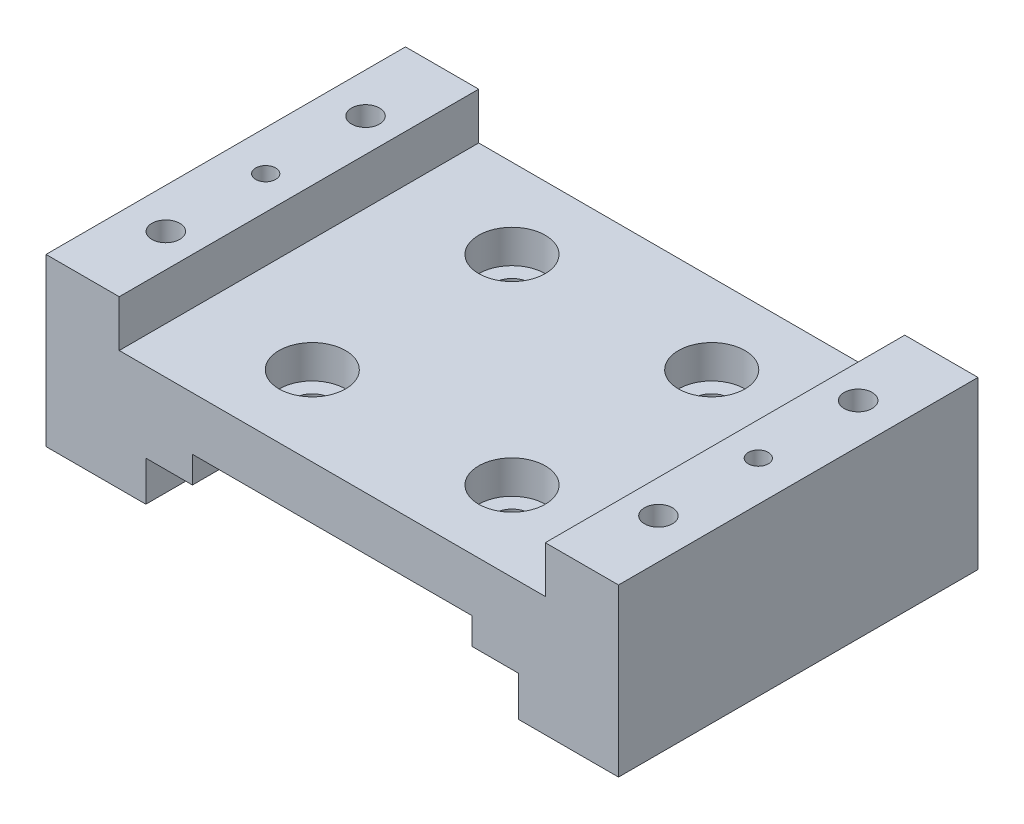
ISO-10303-21;
HEADER;
FILE_DESCRIPTION(('STEP AP214'),'2;1');
FILE_NAME('part.step','',(''),(''),'','','');
FILE_SCHEMA(('AUTOMOTIVE_DESIGN { 1 0 10303 214 1 1 1 1 }'));
ENDSEC;
DATA;
#1=APPLICATION_CONTEXT('core data for automotive mechanical design processes');
#2=APPLICATION_PROTOCOL_DEFINITION('international standard','automotive_design',2000,#1);
#3=PRODUCT_CONTEXT('',#1,'mechanical');
#4=PRODUCT('Part','Part','',(#3));
#5=PRODUCT_RELATED_PRODUCT_CATEGORY('part','',(#4));
#6=PRODUCT_DEFINITION_FORMATION('','',#4);
#7=PRODUCT_DEFINITION_CONTEXT('part definition',#1,'design');
#8=PRODUCT_DEFINITION('design','',#6,#7);
#9=PRODUCT_DEFINITION_SHAPE('','',#8);
#10=(LENGTH_UNIT() NAMED_UNIT(*) SI_UNIT(.MILLI.,.METRE.));
#11=(NAMED_UNIT(*) PLANE_ANGLE_UNIT() SI_UNIT($,.RADIAN.));
#12=(NAMED_UNIT(*) SI_UNIT($,.STERADIAN.) SOLID_ANGLE_UNIT());
#13=UNCERTAINTY_MEASURE_WITH_UNIT(LENGTH_MEASURE(1.E-05),#10,'distance_accuracy_value','');
#14=(GEOMETRIC_REPRESENTATION_CONTEXT(3) GLOBAL_UNCERTAINTY_ASSIGNED_CONTEXT((#13)) GLOBAL_UNIT_ASSIGNED_CONTEXT((#10,
#11,#12)) REPRESENTATION_CONTEXT('',''));
#15=CARTESIAN_POINT('',(0.,0.,0.));
#16=DIRECTION('',(0.,0.,1.));
#17=DIRECTION('',(1.,0.,0.));
#18=AXIS2_PLACEMENT_3D('',#15,#16,#17);
#19=CARTESIAN_POINT('',(21.,0.,54.));
#20=DIRECTION('',(1.,0.,0.));
#21=DIRECTION('',(0.,0.,-1.));
#22=AXIS2_PLACEMENT_3D('',#19,#20,#21);
#23=PLANE('',#22);
#24=DIRECTION('',(0.,-1.,0.));
#25=VECTOR('',#24,1.);
#26=CARTESIAN_POINT('',(21.,0.,0.));
#27=LINE('',#26,#25);
#28=CARTESIAN_POINT('',(21.,0.,0.));
#29=VERTEX_POINT('',#28);
#30=CARTESIAN_POINT('',(21.,-4.,0.));
#31=VERTEX_POINT('',#30);
#32=EDGE_CURVE('E191',#29,#31,#27,.T.);
#33=ORIENTED_EDGE('',*,*,#32,.T.);
#34=DIRECTION('',(0.,0.,-1.));
#35=VECTOR('',#34,1.);
#36=CARTESIAN_POINT('',(21.,-4.,54.));
#37=LINE('',#36,#35);
#38=CARTESIAN_POINT('',(21.,-4.,54.));
#39=VERTEX_POINT('',#38);
#40=EDGE_CURVE('E11',#39,#31,#37,.T.);
#41=ORIENTED_EDGE('',*,*,#40,.F.);
#42=DIRECTION('',(0.,-1.,0.));
#43=VECTOR('',#42,1.);
#44=CARTESIAN_POINT('',(21.,0.,54.));
#45=LINE('',#44,#43);
#46=CARTESIAN_POINT('',(21.,0.,54.));
#47=VERTEX_POINT('',#46);
#48=EDGE_CURVE('E222',#47,#39,#45,.T.);
#49=ORIENTED_EDGE('',*,*,#48,.F.);
#50=DIRECTION('',(0.,0.,-1.));
#51=VECTOR('',#50,1.);
#52=CARTESIAN_POINT('',(21.,0.,54.));
#53=LINE('',#52,#51);
#54=EDGE_CURVE('E187',#47,#29,#53,.T.);
#55=ORIENTED_EDGE('',*,*,#54,.T.);
#56=EDGE_LOOP('',(#33,#41,#49,#55));
#57=FACE_BOUND('',#56,.T.);
#58=ADVANCED_FACE('F42',(#57),#23,.F.);
#59=CARTESIAN_POINT('',(21.,-4.,54.));
#60=DIRECTION('',(0.,1.,0.));
#61=DIRECTION('',(0.,0.,1.));
#62=AXIS2_PLACEMENT_3D('',#59,#60,#61);
#63=PLANE('',#62);
#64=DIRECTION('',(1.,0.,0.));
#65=VECTOR('',#64,1.);
#66=CARTESIAN_POINT('',(21.,-4.,0.));
#67=LINE('',#66,#65);
#68=CARTESIAN_POINT('',(28.,-4.,0.));
#69=VERTEX_POINT('',#68);
#70=EDGE_CURVE('E194',#31,#69,#67,.T.);
#71=ORIENTED_EDGE('',*,*,#70,.T.);
#72=DIRECTION('',(0.,0.,-1.));
#73=VECTOR('',#72,1.);
#74=CARTESIAN_POINT('',(28.,-4.,54.));
#75=LINE('',#74,#73);
#76=CARTESIAN_POINT('',(28.,-4.,54.));
#77=VERTEX_POINT('',#76);
#78=EDGE_CURVE('E51',#77,#69,#75,.T.);
#79=ORIENTED_EDGE('',*,*,#78,.F.);
#80=DIRECTION('',(1.,0.,0.));
#81=VECTOR('',#80,1.);
#82=CARTESIAN_POINT('',(21.,-4.,54.));
#83=LINE('',#82,#81);
#84=EDGE_CURVE('E128',#39,#77,#83,.T.);
#85=ORIENTED_EDGE('',*,*,#84,.F.);
#86=ORIENTED_EDGE('',*,*,#40,.T.);
#87=EDGE_LOOP('',(#71,#79,#85,#86));
#88=FACE_BOUND('',#87,.T.);
#89=ADVANCED_FACE('F370',(#88),#63,.F.);
#90=CARTESIAN_POINT('',(28.,-4.,54.));
#91=DIRECTION('',(1.,0.,0.));
#92=DIRECTION('',(0.,0.,-1.));
#93=AXIS2_PLACEMENT_3D('',#90,#91,#92);
#94=PLANE('',#93);
#95=DIRECTION('',(0.,-1.,0.));
#96=VECTOR('',#95,1.);
#97=CARTESIAN_POINT('',(28.,-4.,0.));
#98=LINE('',#97,#96);
#99=CARTESIAN_POINT('',(28.,-10.,0.));
#100=VERTEX_POINT('',#99);
#101=EDGE_CURVE('E197',#69,#100,#98,.T.);
#102=ORIENTED_EDGE('',*,*,#101,.T.);
#103=DIRECTION('',(0.,0.,-1.));
#104=VECTOR('',#103,1.);
#105=CARTESIAN_POINT('',(28.,-10.,54.));
#106=LINE('',#105,#104);
#107=CARTESIAN_POINT('',(28.,-10.,54.));
#108=VERTEX_POINT('',#107);
#109=EDGE_CURVE('E253',#108,#100,#106,.T.);
#110=ORIENTED_EDGE('',*,*,#109,.F.);
#111=DIRECTION('',(0.,-1.,0.));
#112=VECTOR('',#111,1.);
#113=CARTESIAN_POINT('',(28.,-4.,54.));
#114=LINE('',#113,#112);
#115=EDGE_CURVE('E321',#77,#108,#114,.T.);
#116=ORIENTED_EDGE('',*,*,#115,.F.);
#117=ORIENTED_EDGE('',*,*,#78,.T.);
#118=EDGE_LOOP('',(#102,#110,#116,#117));
#119=FACE_BOUND('',#118,.T.);
#120=ADVANCED_FACE('F374',(#119),#94,.F.);
#121=CARTESIAN_POINT('',(28.,-10.,54.));
#122=DIRECTION('',(0.,1.,0.));
#123=DIRECTION('',(0.,0.,1.));
#124=AXIS2_PLACEMENT_3D('',#121,#122,#123);
#125=PLANE('',#124);
#126=CARTESIAN_POINT('',(37.,-10.,31.));
#127=DIRECTION('',(0.,-1.,0.));
#128=DIRECTION('',(0.,0.,-1.));
#129=AXIS2_PLACEMENT_3D('',#126,#127,#128);
#130=CIRCLE('',#129,1.02499999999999);
#131=CARTESIAN_POINT('',(37.,-10.,29.975));
#132=VERTEX_POINT('',#131);
#133=EDGE_CURVE('E844',#132,#132,#130,.T.);
#134=ORIENTED_EDGE('',*,*,#133,.F.);
#135=EDGE_LOOP('',(#134));
#136=FACE_BOUND('',#135,.T.);
#137=CARTESIAN_POINT('',(37.,-10.,23.));
#138=DIRECTION('',(0.,-1.,0.));
#139=DIRECTION('',(0.,0.,-1.));
#140=AXIS2_PLACEMENT_3D('',#137,#138,#139);
#141=CIRCLE('',#140,1.02499999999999);
#142=CARTESIAN_POINT('',(37.,-10.,21.975));
#143=VERTEX_POINT('',#142);
#144=EDGE_CURVE('E850',#143,#143,#141,.T.);
#145=ORIENTED_EDGE('',*,*,#144,.F.);
#146=EDGE_LOOP('',(#145));
#147=FACE_BOUND('',#146,.T.);
#148=DIRECTION('',(1.,0.,0.));
#149=VECTOR('',#148,1.);
#150=CARTESIAN_POINT('',(28.,-10.,0.));
#151=LINE('',#150,#149);
#152=CARTESIAN_POINT('',(43.,-10.,0.));
#153=VERTEX_POINT('',#152);
#154=EDGE_CURVE('E199',#100,#153,#151,.T.);
#155=ORIENTED_EDGE('',*,*,#154,.T.);
#156=DIRECTION('',(0.,0.,-1.));
#157=VECTOR('',#156,1.);
#158=CARTESIAN_POINT('',(43.,-10.,54.));
#159=LINE('',#158,#157);
#160=CARTESIAN_POINT('',(43.,-10.,54.));
#161=VERTEX_POINT('',#160);
#162=EDGE_CURVE('E250',#161,#153,#159,.T.);
#163=ORIENTED_EDGE('',*,*,#162,.F.);
#164=DIRECTION('',(1.,0.,0.));
#165=VECTOR('',#164,1.);
#166=CARTESIAN_POINT('',(28.,-10.,54.));
#167=LINE('',#166,#165);
#168=EDGE_CURVE('E323',#108,#161,#167,.T.);
#169=ORIENTED_EDGE('',*,*,#168,.F.);
#170=ORIENTED_EDGE('',*,*,#109,.T.);
#171=EDGE_LOOP('',(#155,#163,#169,#170));
#172=FACE_BOUND('',#171,.T.);
#173=ADVANCED_FACE('F378',(#136,#147,#172),#125,.F.);
#174=CARTESIAN_POINT('',(43.,-10.,54.));
#175=DIRECTION('',(-1.,0.,0.));
#176=DIRECTION('',(0.,0.,1.));
#177=AXIS2_PLACEMENT_3D('',#174,#175,#176);
#178=PLANE('',#177);
#179=DIRECTION('',(0.,1.,0.));
#180=VECTOR('',#179,1.);
#181=CARTESIAN_POINT('',(43.,-10.,0.));
#182=LINE('',#181,#180);
#183=CARTESIAN_POINT('',(43.,15.,0.));
#184=VERTEX_POINT('',#183);
#185=EDGE_CURVE('E201',#153,#184,#182,.T.);
#186=ORIENTED_EDGE('',*,*,#185,.T.);
#187=DIRECTION('',(0.,0.,-1.));
#188=VECTOR('',#187,1.);
#189=CARTESIAN_POINT('',(43.,15.,54.));
#190=LINE('',#189,#188);
#191=CARTESIAN_POINT('',(43.,15.,54.));
#192=VERTEX_POINT('',#191);
#193=EDGE_CURVE('E247',#192,#184,#190,.T.);
#194=ORIENTED_EDGE('',*,*,#193,.F.);
#195=DIRECTION('',(0.,1.,0.));
#196=VECTOR('',#195,1.);
#197=CARTESIAN_POINT('',(43.,-10.,54.));
#198=LINE('',#197,#196);
#199=EDGE_CURVE('E325',#161,#192,#198,.T.);
#200=ORIENTED_EDGE('',*,*,#199,.F.);
#201=ORIENTED_EDGE('',*,*,#162,.T.);
#202=EDGE_LOOP('',(#186,#194,#200,#201));
#203=FACE_BOUND('',#202,.T.);
#204=ADVANCED_FACE('F384',(#203),#178,.F.);
#205=CARTESIAN_POINT('',(43.,15.,54.));
#206=DIRECTION('',(0.,-1.,0.));
#207=DIRECTION('',(0.,0.,-1.));
#208=AXIS2_PLACEMENT_3D('',#205,#206,#207);
#209=PLANE('',#208);
#210=CARTESIAN_POINT('',(37.,15.,27.));
#211=DIRECTION('',(0.,1.,0.));
#212=DIRECTION('',(-1.,0.,0.));
#213=AXIS2_PLACEMENT_3D('',#210,#211,#212);
#214=CIRCLE('',#213,1.5);
#215=CARTESIAN_POINT('',(35.5,15.,27.));
#216=VERTEX_POINT('',#215);
#217=EDGE_CURVE('E823',#216,#216,#214,.T.);
#218=ORIENTED_EDGE('',*,*,#217,.F.);
#219=EDGE_LOOP('',(#218));
#220=FACE_BOUND('',#219,.T.);
#221=CARTESIAN_POINT('',(37.,15.,42.));
#222=DIRECTION('',(0.,1.,0.));
#223=DIRECTION('',(0.,0.,1.));
#224=AXIS2_PLACEMENT_3D('',#221,#222,#223);
#225=CIRCLE('',#224,2.1);
#226=CARTESIAN_POINT('',(37.,15.,44.1));
#227=VERTEX_POINT('',#226);
#228=EDGE_CURVE('E302',#227,#227,#225,.T.);
#229=ORIENTED_EDGE('',*,*,#228,.F.);
#230=EDGE_LOOP('',(#229));
#231=FACE_BOUND('',#230,.T.);
#232=CARTESIAN_POINT('',(37.,15.,12.));
#233=DIRECTION('',(0.,1.,0.));
#234=DIRECTION('',(0.,0.,1.));
#235=AXIS2_PLACEMENT_3D('',#232,#233,#234);
#236=CIRCLE('',#235,2.1);
#237=CARTESIAN_POINT('',(37.,15.,14.1));
#238=VERTEX_POINT('',#237);
#239=EDGE_CURVE('E314',#238,#238,#236,.T.);
#240=ORIENTED_EDGE('',*,*,#239,.F.);
#241=EDGE_LOOP('',(#240));
#242=FACE_BOUND('',#241,.T.);
#243=DIRECTION('',(-1.,0.,0.));
#244=VECTOR('',#243,1.);
#245=CARTESIAN_POINT('',(43.,15.,0.));
#246=LINE('',#245,#244);
#247=CARTESIAN_POINT('',(32.,15.,0.));
#248=VERTEX_POINT('',#247);
#249=EDGE_CURVE('E203',#184,#248,#246,.T.);
#250=ORIENTED_EDGE('',*,*,#249,.T.);
#251=DIRECTION('',(0.,0.,-1.));
#252=VECTOR('',#251,1.);
#253=CARTESIAN_POINT('',(32.,15.,54.));
#254=LINE('',#253,#252);
#255=CARTESIAN_POINT('',(32.,15.,54.));
#256=VERTEX_POINT('',#255);
#257=EDGE_CURVE('E244',#256,#248,#254,.T.);
#258=ORIENTED_EDGE('',*,*,#257,.F.);
#259=DIRECTION('',(-1.,0.,0.));
#260=VECTOR('',#259,1.);
#261=CARTESIAN_POINT('',(43.,15.,54.));
#262=LINE('',#261,#260);
#263=EDGE_CURVE('E327',#192,#256,#262,.T.);
#264=ORIENTED_EDGE('',*,*,#263,.F.);
#265=ORIENTED_EDGE('',*,*,#193,.T.);
#266=EDGE_LOOP('',(#250,#258,#264,#265));
#267=FACE_BOUND('',#266,.T.);
#268=ADVANCED_FACE('F388',(#220,#231,#242,#267),#209,.F.);
#269=CARTESIAN_POINT('',(32.,15.,54.));
#270=DIRECTION('',(1.,0.,0.));
#271=DIRECTION('',(0.,0.,-1.));
#272=AXIS2_PLACEMENT_3D('',#269,#270,#271);
#273=PLANE('',#272);
#274=DIRECTION('',(0.,-1.,0.));
#275=VECTOR('',#274,1.);
#276=CARTESIAN_POINT('',(32.,15.,0.));
#277=LINE('',#276,#275);
#278=CARTESIAN_POINT('',(32.,8.,0.));
#279=VERTEX_POINT('',#278);
#280=EDGE_CURVE('E205',#248,#279,#277,.T.);
#281=ORIENTED_EDGE('',*,*,#280,.T.);
#282=DIRECTION('',(0.,0.,-1.));
#283=VECTOR('',#282,1.);
#284=CARTESIAN_POINT('',(32.,8.,54.));
#285=LINE('',#284,#283);
#286=CARTESIAN_POINT('',(32.,8.,54.));
#287=VERTEX_POINT('',#286);
#288=EDGE_CURVE('E241',#287,#279,#285,.T.);
#289=ORIENTED_EDGE('',*,*,#288,.F.);
#290=DIRECTION('',(0.,-1.,0.));
#291=VECTOR('',#290,1.);
#292=CARTESIAN_POINT('',(32.,15.,54.));
#293=LINE('',#292,#291);
#294=EDGE_CURVE('E329',#256,#287,#293,.T.);
#295=ORIENTED_EDGE('',*,*,#294,.F.);
#296=ORIENTED_EDGE('',*,*,#257,.T.);
#297=EDGE_LOOP('',(#281,#289,#295,#296));
#298=FACE_BOUND('',#297,.T.);
#299=ADVANCED_FACE('F392',(#298),#273,.F.);
#300=CARTESIAN_POINT('',(32.,8.,54.));
#301=DIRECTION('',(0.,-1.,0.));
#302=DIRECTION('',(1.,0.,0.));
#303=AXIS2_PLACEMENT_3D('',#300,#301,#302);
#304=PLANE('',#303);
#305=CARTESIAN_POINT('',(-15.,8.,12.));
#306=DIRECTION('',(0.,1.,0.));
#307=DIRECTION('',(0.,0.,1.));
#308=AXIS2_PLACEMENT_3D('',#305,#306,#307);
#309=CIRCLE('',#308,5.);
#310=CARTESIAN_POINT('',(-15.,8.,17.));
#311=VERTEX_POINT('',#310);
#312=EDGE_CURVE('E856',#311,#311,#309,.T.);
#313=ORIENTED_EDGE('',*,*,#312,.F.);
#314=EDGE_LOOP('',(#313));
#315=FACE_BOUND('',#314,.T.);
#316=CARTESIAN_POINT('',(15.,8.,12.));
#317=DIRECTION('',(0.,1.,0.));
#318=DIRECTION('',(0.,0.,1.));
#319=AXIS2_PLACEMENT_3D('',#316,#317,#318);
#320=CIRCLE('',#319,5.);
#321=CARTESIAN_POINT('',(15.,8.,17.));
#322=VERTEX_POINT('',#321);
#323=EDGE_CURVE('E282',#322,#322,#320,.T.);
#324=ORIENTED_EDGE('',*,*,#323,.F.);
#325=EDGE_LOOP('',(#324));
#326=FACE_BOUND('',#325,.T.);
#327=CARTESIAN_POINT('',(15.,8.,42.));
#328=DIRECTION('',(0.,1.,0.));
#329=DIRECTION('',(0.,0.,1.));
#330=AXIS2_PLACEMENT_3D('',#327,#328,#329);
#331=CIRCLE('',#330,5.);
#332=CARTESIAN_POINT('',(15.,8.,47.));
#333=VERTEX_POINT('',#332);
#334=EDGE_CURVE('E269',#333,#333,#331,.T.);
#335=ORIENTED_EDGE('',*,*,#334,.F.);
#336=EDGE_LOOP('',(#335));
#337=FACE_BOUND('',#336,.T.);
#338=CARTESIAN_POINT('',(-15.,8.,42.));
#339=DIRECTION('',(0.,1.,0.));
#340=DIRECTION('',(0.,0.,1.));
#341=AXIS2_PLACEMENT_3D('',#338,#339,#340);
#342=CIRCLE('',#341,5.);
#343=CARTESIAN_POINT('',(-15.,8.,47.));
#344=VERTEX_POINT('',#343);
#345=EDGE_CURVE('E265',#344,#344,#342,.T.);
#346=ORIENTED_EDGE('',*,*,#345,.F.);
#347=EDGE_LOOP('',(#346));
#348=FACE_BOUND('',#347,.T.);
#349=DIRECTION('',(-1.,0.,0.));
#350=VECTOR('',#349,1.);
#351=CARTESIAN_POINT('',(32.,8.,0.));
#352=LINE('',#351,#350);
#353=CARTESIAN_POINT('',(-32.,7.99999999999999,0.));
#354=VERTEX_POINT('',#353);
#355=EDGE_CURVE('E207',#279,#354,#352,.T.);
#356=ORIENTED_EDGE('',*,*,#355,.T.);
#357=DIRECTION('',(0.,0.,-1.));
#358=VECTOR('',#357,1.);
#359=CARTESIAN_POINT('',(-32.,7.99999999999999,54.));
#360=LINE('',#359,#358);
#361=CARTESIAN_POINT('',(-32.,7.99999999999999,54.));
#362=VERTEX_POINT('',#361);
#363=EDGE_CURVE('E238',#362,#354,#360,.T.);
#364=ORIENTED_EDGE('',*,*,#363,.F.);
#365=DIRECTION('',(-1.,0.,0.));
#366=VECTOR('',#365,1.);
#367=CARTESIAN_POINT('',(32.,8.,54.));
#368=LINE('',#367,#366);
#369=EDGE_CURVE('E331',#287,#362,#368,.T.);
#370=ORIENTED_EDGE('',*,*,#369,.F.);
#371=ORIENTED_EDGE('',*,*,#288,.T.);
#372=EDGE_LOOP('',(#356,#364,#370,#371));
#373=FACE_BOUND('',#372,.T.);
#374=ADVANCED_FACE('F396',(#315,#326,#337,#348,#373),#304,.F.);
#375=CARTESIAN_POINT('',(-32.,15.,54.));
#376=DIRECTION('',(-1.,0.,0.));
#377=DIRECTION('',(0.,0.,1.));
#378=AXIS2_PLACEMENT_3D('',#375,#376,#377);
#379=PLANE('',#378);
#380=DIRECTION('',(0.,1.,0.));
#381=VECTOR('',#380,1.);
#382=CARTESIAN_POINT('',(-32.,15.,0.));
#383=LINE('',#382,#381);
#384=CARTESIAN_POINT('',(-32.,15.,0.));
#385=VERTEX_POINT('',#384);
#386=EDGE_CURVE('E209',#354,#385,#383,.T.);
#387=ORIENTED_EDGE('',*,*,#386,.T.);
#388=DIRECTION('',(0.,0.,-1.));
#389=VECTOR('',#388,1.);
#390=CARTESIAN_POINT('',(-32.,15.,54.));
#391=LINE('',#390,#389);
#392=CARTESIAN_POINT('',(-32.,15.,54.));
#393=VERTEX_POINT('',#392);
#394=EDGE_CURVE('E235',#393,#385,#391,.T.);
#395=ORIENTED_EDGE('',*,*,#394,.F.);
#396=DIRECTION('',(0.,1.,0.));
#397=VECTOR('',#396,1.);
#398=CARTESIAN_POINT('',(-32.,15.,54.));
#399=LINE('',#398,#397);
#400=EDGE_CURVE('E333',#362,#393,#399,.T.);
#401=ORIENTED_EDGE('',*,*,#400,.F.);
#402=ORIENTED_EDGE('',*,*,#363,.T.);
#403=EDGE_LOOP('',(#387,#395,#401,#402));
#404=FACE_BOUND('',#403,.T.);
#405=ADVANCED_FACE('F400',(#404),#379,.F.);
#406=CARTESIAN_POINT('',(-43.,15.,54.));
#407=DIRECTION('',(0.,-1.,0.));
#408=DIRECTION('',(1.,0.,0.));
#409=AXIS2_PLACEMENT_3D('',#406,#407,#408);
#410=PLANE('',#409);
#411=CARTESIAN_POINT('',(-37.,15.,27.));
#412=DIRECTION('',(0.,1.,0.));
#413=DIRECTION('',(-1.,0.,0.));
#414=AXIS2_PLACEMENT_3D('',#411,#412,#413);
#415=CIRCLE('',#414,1.5);
#416=CARTESIAN_POINT('',(-38.5,15.,27.));
#417=VERTEX_POINT('',#416);
#418=EDGE_CURVE('E822',#417,#417,#415,.T.);
#419=ORIENTED_EDGE('',*,*,#418,.F.);
#420=EDGE_LOOP('',(#419));
#421=FACE_BOUND('',#420,.T.);
#422=CARTESIAN_POINT('',(-37.,15.,12.));
#423=DIRECTION('',(0.,1.,0.));
#424=DIRECTION('',(0.,0.,1.));
#425=AXIS2_PLACEMENT_3D('',#422,#423,#424);
#426=CIRCLE('',#425,2.1);
#427=CARTESIAN_POINT('',(-37.,15.,14.1));
#428=VERTEX_POINT('',#427);
#429=EDGE_CURVE('E261',#428,#428,#426,.T.);
#430=ORIENTED_EDGE('',*,*,#429,.F.);
#431=EDGE_LOOP('',(#430));
#432=FACE_BOUND('',#431,.T.);
#433=CARTESIAN_POINT('',(-37.,15.,42.));
#434=DIRECTION('',(0.,1.,0.));
#435=DIRECTION('',(0.,0.,1.));
#436=AXIS2_PLACEMENT_3D('',#433,#434,#435);
#437=CIRCLE('',#436,2.1);
#438=CARTESIAN_POINT('',(-37.,15.,44.1));
#439=VERTEX_POINT('',#438);
#440=EDGE_CURVE('E308',#439,#439,#437,.T.);
#441=ORIENTED_EDGE('',*,*,#440,.F.);
#442=EDGE_LOOP('',(#441));
#443=FACE_BOUND('',#442,.T.);
#444=DIRECTION('',(-1.,0.,0.));
#445=VECTOR('',#444,1.);
#446=CARTESIAN_POINT('',(-43.,15.,0.));
#447=LINE('',#446,#445);
#448=CARTESIAN_POINT('',(-43.,15.,0.));
#449=VERTEX_POINT('',#448);
#450=EDGE_CURVE('E211',#385,#449,#447,.T.);
#451=ORIENTED_EDGE('',*,*,#450,.T.);
#452=DIRECTION('',(0.,0.,-1.));
#453=VECTOR('',#452,1.);
#454=CARTESIAN_POINT('',(-43.,15.,54.));
#455=LINE('',#454,#453);
#456=CARTESIAN_POINT('',(-43.,15.,54.));
#457=VERTEX_POINT('',#456);
#458=EDGE_CURVE('E232',#457,#449,#455,.T.);
#459=ORIENTED_EDGE('',*,*,#458,.F.);
#460=DIRECTION('',(-1.,0.,0.));
#461=VECTOR('',#460,1.);
#462=CARTESIAN_POINT('',(-43.,15.,54.));
#463=LINE('',#462,#461);
#464=EDGE_CURVE('E335',#393,#457,#463,.T.);
#465=ORIENTED_EDGE('',*,*,#464,.F.);
#466=ORIENTED_EDGE('',*,*,#394,.T.);
#467=EDGE_LOOP('',(#451,#459,#465,#466));
#468=FACE_BOUND('',#467,.T.);
#469=ADVANCED_FACE('F404',(#421,#432,#443,#468),#410,.F.);
#470=CARTESIAN_POINT('',(-43.,-9.99999999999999,54.));
#471=DIRECTION('',(1.,0.,0.));
#472=DIRECTION('',(0.,0.,-1.));
#473=AXIS2_PLACEMENT_3D('',#470,#471,#472);
#474=PLANE('',#473);
#475=DIRECTION('',(0.,-1.,0.));
#476=VECTOR('',#475,1.);
#477=CARTESIAN_POINT('',(-43.,-9.99999999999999,0.));
#478=LINE('',#477,#476);
#479=CARTESIAN_POINT('',(-43.,-9.99999999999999,0.));
#480=VERTEX_POINT('',#479);
#481=EDGE_CURVE('E213',#449,#480,#478,.T.);
#482=ORIENTED_EDGE('',*,*,#481,.T.);
#483=DIRECTION('',(0.,0.,-1.));
#484=VECTOR('',#483,1.);
#485=CARTESIAN_POINT('',(-43.,-9.99999999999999,54.));
#486=LINE('',#485,#484);
#487=CARTESIAN_POINT('',(-43.,-9.99999999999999,54.));
#488=VERTEX_POINT('',#487);
#489=EDGE_CURVE('E229',#488,#480,#486,.T.);
#490=ORIENTED_EDGE('',*,*,#489,.F.);
#491=DIRECTION('',(0.,-1.,0.));
#492=VECTOR('',#491,1.);
#493=CARTESIAN_POINT('',(-43.,-9.99999999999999,54.));
#494=LINE('',#493,#492);
#495=EDGE_CURVE('E337',#457,#488,#494,.T.);
#496=ORIENTED_EDGE('',*,*,#495,.F.);
#497=ORIENTED_EDGE('',*,*,#458,.T.);
#498=EDGE_LOOP('',(#482,#490,#496,#497));
#499=FACE_BOUND('',#498,.T.);
#500=ADVANCED_FACE('F408',(#499),#474,.F.);
#501=CARTESIAN_POINT('',(-28.,-10.,54.));
#502=DIRECTION('',(0.,1.,0.));
#503=DIRECTION('',(-1.,0.,0.));
#504=AXIS2_PLACEMENT_3D('',#501,#502,#503);
#505=PLANE('',#504);
#506=CARTESIAN_POINT('',(-37.,-10.,31.));
#507=DIRECTION('',(0.,-1.,0.));
#508=DIRECTION('',(0.,0.,-1.));
#509=AXIS2_PLACEMENT_3D('',#506,#507,#508);
#510=CIRCLE('',#509,1.02499999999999);
#511=CARTESIAN_POINT('',(-37.,-10.,29.975));
#512=VERTEX_POINT('',#511);
#513=EDGE_CURVE('E832',#512,#512,#510,.T.);
#514=ORIENTED_EDGE('',*,*,#513,.F.);
#515=EDGE_LOOP('',(#514));
#516=FACE_BOUND('',#515,.T.);
#517=CARTESIAN_POINT('',(-37.,-10.,23.));
#518=DIRECTION('',(0.,-1.,0.));
#519=DIRECTION('',(0.,0.,-1.));
#520=AXIS2_PLACEMENT_3D('',#517,#518,#519);
#521=CIRCLE('',#520,1.02499999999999);
#522=CARTESIAN_POINT('',(-37.,-10.,21.975));
#523=VERTEX_POINT('',#522);
#524=EDGE_CURVE('E838',#523,#523,#521,.T.);
#525=ORIENTED_EDGE('',*,*,#524,.F.);
#526=EDGE_LOOP('',(#525));
#527=FACE_BOUND('',#526,.T.);
#528=DIRECTION('',(1.,0.,0.));
#529=VECTOR('',#528,1.);
#530=CARTESIAN_POINT('',(-28.,-10.,0.));
#531=LINE('',#530,#529);
#532=CARTESIAN_POINT('',(-28.,-10.,0.));
#533=VERTEX_POINT('',#532);
#534=EDGE_CURVE('E215',#480,#533,#531,.T.);
#535=ORIENTED_EDGE('',*,*,#534,.T.);
#536=DIRECTION('',(0.,0.,-1.));
#537=VECTOR('',#536,1.);
#538=CARTESIAN_POINT('',(-28.,-10.,54.));
#539=LINE('',#538,#537);
#540=CARTESIAN_POINT('',(-28.,-10.,54.));
#541=VERTEX_POINT('',#540);
#542=EDGE_CURVE('E226',#541,#533,#539,.T.);
#543=ORIENTED_EDGE('',*,*,#542,.F.);
#544=DIRECTION('',(1.,0.,0.));
#545=VECTOR('',#544,1.);
#546=CARTESIAN_POINT('',(-28.,-10.,54.));
#547=LINE('',#546,#545);
#548=EDGE_CURVE('E339',#488,#541,#547,.T.);
#549=ORIENTED_EDGE('',*,*,#548,.F.);
#550=ORIENTED_EDGE('',*,*,#489,.T.);
#551=EDGE_LOOP('',(#535,#543,#549,#550));
#552=FACE_BOUND('',#551,.T.);
#553=ADVANCED_FACE('F345',(#516,#527,#552),#505,.F.);
#554=CARTESIAN_POINT('',(-28.,-4.,54.));
#555=DIRECTION('',(-1.,0.,0.));
#556=DIRECTION('',(0.,0.,1.));
#557=AXIS2_PLACEMENT_3D('',#554,#555,#556);
#558=PLANE('',#557);
#559=DIRECTION('',(0.,1.,0.));
#560=VECTOR('',#559,1.);
#561=CARTESIAN_POINT('',(-28.,-4.,0.));
#562=LINE('',#561,#560);
#563=CARTESIAN_POINT('',(-28.,-4.,0.));
#564=VERTEX_POINT('',#563);
#565=EDGE_CURVE('E217',#533,#564,#562,.T.);
#566=ORIENTED_EDGE('',*,*,#565,.T.);
#567=DIRECTION('',(0.,0.,-1.));
#568=VECTOR('',#567,1.);
#569=CARTESIAN_POINT('',(-28.,-4.,54.));
#570=LINE('',#569,#568);
#571=CARTESIAN_POINT('',(-28.,-4.,54.));
#572=VERTEX_POINT('',#571);
#573=EDGE_CURVE('E182',#572,#564,#570,.T.);
#574=ORIENTED_EDGE('',*,*,#573,.F.);
#575=DIRECTION('',(0.,1.,0.));
#576=VECTOR('',#575,1.);
#577=CARTESIAN_POINT('',(-28.,-4.,54.));
#578=LINE('',#577,#576);
#579=EDGE_CURVE('E173',#541,#572,#578,.T.);
#580=ORIENTED_EDGE('',*,*,#579,.F.);
#581=ORIENTED_EDGE('',*,*,#542,.T.);
#582=EDGE_LOOP('',(#566,#574,#580,#581));
#583=FACE_BOUND('',#582,.T.);
#584=ADVANCED_FACE('F349',(#583),#558,.F.);
#585=CARTESIAN_POINT('',(-21.,-4.,54.));
#586=DIRECTION('',(0.,1.,0.));
#587=DIRECTION('',(0.,0.,1.));
#588=AXIS2_PLACEMENT_3D('',#585,#586,#587);
#589=PLANE('',#588);
#590=DIRECTION('',(1.,0.,0.));
#591=VECTOR('',#590,1.);
#592=CARTESIAN_POINT('',(-21.,-4.,0.));
#593=LINE('',#592,#591);
#594=CARTESIAN_POINT('',(-21.,-4.,0.));
#595=VERTEX_POINT('',#594);
#596=EDGE_CURVE('E181',#564,#595,#593,.T.);
#597=ORIENTED_EDGE('',*,*,#596,.T.);
#598=DIRECTION('',(0.,0.,-1.));
#599=VECTOR('',#598,1.);
#600=CARTESIAN_POINT('',(-21.,-4.,54.));
#601=LINE('',#600,#599);
#602=CARTESIAN_POINT('',(-21.,-4.,54.));
#603=VERTEX_POINT('',#602);
#604=EDGE_CURVE('E178',#603,#595,#601,.T.);
#605=ORIENTED_EDGE('',*,*,#604,.F.);
#606=DIRECTION('',(1.,0.,0.));
#607=VECTOR('',#606,1.);
#608=CARTESIAN_POINT('',(-21.,-4.,54.));
#609=LINE('',#608,#607);
#610=EDGE_CURVE('E167',#572,#603,#609,.T.);
#611=ORIENTED_EDGE('',*,*,#610,.F.);
#612=ORIENTED_EDGE('',*,*,#573,.T.);
#613=EDGE_LOOP('',(#597,#605,#611,#612));
#614=FACE_BOUND('',#613,.T.);
#615=ADVANCED_FACE('F179',(#614),#589,.F.);
#616=CARTESIAN_POINT('',(-21.,0.,54.));
#617=DIRECTION('',(-1.,0.,0.));
#618=DIRECTION('',(0.,0.,1.));
#619=AXIS2_PLACEMENT_3D('',#616,#617,#618);
#620=PLANE('',#619);
#621=DIRECTION('',(0.,1.,0.));
#622=VECTOR('',#621,1.);
#623=CARTESIAN_POINT('',(-21.,0.,0.));
#624=LINE('',#623,#622);
#625=CARTESIAN_POINT('',(-21.,0.,0.));
#626=VERTEX_POINT('',#625);
#627=EDGE_CURVE('E114',#595,#626,#624,.T.);
#628=ORIENTED_EDGE('',*,*,#627,.T.);
#629=DIRECTION('',(0.,0.,-1.));
#630=VECTOR('',#629,1.);
#631=CARTESIAN_POINT('',(-21.,0.,54.));
#632=LINE('',#631,#630);
#633=CARTESIAN_POINT('',(-21.,0.,54.));
#634=VERTEX_POINT('',#633);
#635=EDGE_CURVE('E183',#634,#626,#632,.T.);
#636=ORIENTED_EDGE('',*,*,#635,.F.);
#637=DIRECTION('',(0.,1.,0.));
#638=VECTOR('',#637,1.);
#639=CARTESIAN_POINT('',(-21.,0.,54.));
#640=LINE('',#639,#638);
#641=EDGE_CURVE('E171',#603,#634,#640,.T.);
#642=ORIENTED_EDGE('',*,*,#641,.F.);
#643=ORIENTED_EDGE('',*,*,#604,.T.);
#644=EDGE_LOOP('',(#628,#636,#642,#643));
#645=FACE_BOUND('',#644,.T.);
#646=ADVANCED_FACE('F185',(#645),#620,.F.);
#647=CARTESIAN_POINT('',(-21.,0.,54.));
#648=DIRECTION('',(0.,1.,0.));
#649=DIRECTION('',(-1.,0.,0.));
#650=AXIS2_PLACEMENT_3D('',#647,#648,#649);
#651=PLANE('',#650);
#652=CARTESIAN_POINT('',(-15.,0.,12.));
#653=DIRECTION('',(0.,1.,0.));
#654=DIRECTION('',(-1.,0.,0.));
#655=AXIS2_PLACEMENT_3D('',#652,#653,#654);
#656=CIRCLE('',#655,2.65);
#657=CARTESIAN_POINT('',(-17.65,0.,12.));
#658=VERTEX_POINT('',#657);
#659=EDGE_CURVE('E45',#658,#658,#656,.T.);
#660=ORIENTED_EDGE('',*,*,#659,.T.);
#661=EDGE_LOOP('',(#660));
#662=FACE_BOUND('',#661,.T.);
#663=CARTESIAN_POINT('',(15.,0.,12.));
#664=DIRECTION('',(0.,1.,0.));
#665=DIRECTION('',(-1.,0.,0.));
#666=AXIS2_PLACEMENT_3D('',#663,#664,#665);
#667=CIRCLE('',#666,2.65);
#668=CARTESIAN_POINT('',(12.35,0.,12.));
#669=VERTEX_POINT('',#668);
#670=EDGE_CURVE('E267',#669,#669,#667,.T.);
#671=ORIENTED_EDGE('',*,*,#670,.T.);
#672=EDGE_LOOP('',(#671));
#673=FACE_BOUND('',#672,.T.);
#674=CARTESIAN_POINT('',(15.,0.,42.));
#675=DIRECTION('',(0.,1.,0.));
#676=DIRECTION('',(-1.,0.,0.));
#677=AXIS2_PLACEMENT_3D('',#674,#675,#676);
#678=CIRCLE('',#677,2.65);
#679=CARTESIAN_POINT('',(12.35,0.,42.));
#680=VERTEX_POINT('',#679);
#681=EDGE_CURVE('E263',#680,#680,#678,.T.);
#682=ORIENTED_EDGE('',*,*,#681,.T.);
#683=EDGE_LOOP('',(#682));
#684=FACE_BOUND('',#683,.T.);
#685=CARTESIAN_POINT('',(-15.,0.,42.));
#686=DIRECTION('',(0.,1.,0.));
#687=DIRECTION('',(-1.,0.,0.));
#688=AXIS2_PLACEMENT_3D('',#685,#686,#687);
#689=CIRCLE('',#688,2.65);
#690=CARTESIAN_POINT('',(-17.65,0.,42.));
#691=VERTEX_POINT('',#690);
#692=EDGE_CURVE('E258',#691,#691,#689,.T.);
#693=ORIENTED_EDGE('',*,*,#692,.T.);
#694=EDGE_LOOP('',(#693));
#695=FACE_BOUND('',#694,.T.);
#696=DIRECTION('',(1.,0.,0.));
#697=VECTOR('',#696,1.);
#698=CARTESIAN_POINT('',(-21.,0.,0.));
#699=LINE('',#698,#697);
#700=EDGE_CURVE('E120',#626,#29,#699,.T.);
#701=ORIENTED_EDGE('',*,*,#700,.T.);
#702=ORIENTED_EDGE('',*,*,#54,.F.);
#703=DIRECTION('',(1.,0.,0.));
#704=VECTOR('',#703,1.);
#705=CARTESIAN_POINT('',(-21.,0.,54.));
#706=LINE('',#705,#704);
#707=EDGE_CURVE('E60',#634,#47,#706,.T.);
#708=ORIENTED_EDGE('',*,*,#707,.F.);
#709=ORIENTED_EDGE('',*,*,#635,.T.);
#710=EDGE_LOOP('',(#701,#702,#708,#709));
#711=FACE_BOUND('',#710,.T.);
#712=ADVANCED_FACE('F357',(#662,#673,#684,#695,#711),#651,.F.);
#713=CARTESIAN_POINT('',(21.,-4.,54.));
#714=DIRECTION('',(0.,0.,1.));
#715=DIRECTION('',(1.,0.,0.));
#716=AXIS2_PLACEMENT_3D('',#713,#714,#715);
#717=PLANE('',#716);
#718=ORIENTED_EDGE('',*,*,#48,.T.);
#719=ORIENTED_EDGE('',*,*,#84,.T.);
#720=ORIENTED_EDGE('',*,*,#115,.T.);
#721=ORIENTED_EDGE('',*,*,#168,.T.);
#722=ORIENTED_EDGE('',*,*,#199,.T.);
#723=ORIENTED_EDGE('',*,*,#263,.T.);
#724=ORIENTED_EDGE('',*,*,#294,.T.);
#725=ORIENTED_EDGE('',*,*,#369,.T.);
#726=ORIENTED_EDGE('',*,*,#400,.T.);
#727=ORIENTED_EDGE('',*,*,#464,.T.);
#728=ORIENTED_EDGE('',*,*,#495,.T.);
#729=ORIENTED_EDGE('',*,*,#548,.T.);
#730=ORIENTED_EDGE('',*,*,#579,.T.);
#731=ORIENTED_EDGE('',*,*,#610,.T.);
#732=ORIENTED_EDGE('',*,*,#641,.T.);
#733=ORIENTED_EDGE('',*,*,#707,.T.);
#734=EDGE_LOOP('',(#718,#719,#720,#721,#722,#723,#724,#725,#726,#727,#728,#729,#730,#731,#732,#733));
#735=FACE_BOUND('',#734,.T.);
#736=ADVANCED_FACE('F169',(#735),#717,.T.);
#737=CARTESIAN_POINT('',(21.,-4.,0.));
#738=DIRECTION('',(0.,0.,1.));
#739=DIRECTION('',(1.,0.,0.));
#740=AXIS2_PLACEMENT_3D('',#737,#738,#739);
#741=PLANE('',#740);
#742=ORIENTED_EDGE('',*,*,#32,.F.);
#743=ORIENTED_EDGE('',*,*,#700,.F.);
#744=ORIENTED_EDGE('',*,*,#627,.F.);
#745=ORIENTED_EDGE('',*,*,#596,.F.);
#746=ORIENTED_EDGE('',*,*,#565,.F.);
#747=ORIENTED_EDGE('',*,*,#534,.F.);
#748=ORIENTED_EDGE('',*,*,#481,.F.);
#749=ORIENTED_EDGE('',*,*,#450,.F.);
#750=ORIENTED_EDGE('',*,*,#386,.F.);
#751=ORIENTED_EDGE('',*,*,#355,.F.);
#752=ORIENTED_EDGE('',*,*,#280,.F.);
#753=ORIENTED_EDGE('',*,*,#249,.F.);
#754=ORIENTED_EDGE('',*,*,#185,.F.);
#755=ORIENTED_EDGE('',*,*,#154,.F.);
#756=ORIENTED_EDGE('',*,*,#101,.F.);
#757=ORIENTED_EDGE('',*,*,#70,.F.);
#758=EDGE_LOOP('',(#742,#743,#744,#745,#746,#747,#748,#749,#750,#751,#752,#753,#754,#755,#756,#757));
#759=FACE_BOUND('',#758,.T.);
#760=ADVANCED_FACE('F352',(#759),#741,.F.);
#761=CARTESIAN_POINT('',(37.,2.99999999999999,12.));
#762=DIRECTION('',(0.,1.,0.));
#763=DIRECTION('',(0.,0.,1.));
#764=AXIS2_PLACEMENT_3D('',#761,#762,#763);
#765=CONICAL_SURFACE('',#764,2.1,1.02974425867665);
#766=CARTESIAN_POINT('',(37.,1.73819270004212,12.));
#767=VERTEX_POINT('',#766);
#768=VERTEX_LOOP('',#767);
#769=FACE_BOUND('',#768,.T.);
#770=CARTESIAN_POINT('',(37.,2.99999999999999,12.));
#771=DIRECTION('',(0.,1.,0.));
#772=DIRECTION('',(0.,0.,1.));
#773=AXIS2_PLACEMENT_3D('',#770,#771,#772);
#774=CIRCLE('',#773,2.1);
#775=CARTESIAN_POINT('',(37.,2.99999999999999,14.1));
#776=VERTEX_POINT('',#775);
#777=EDGE_CURVE('E195',#776,#776,#774,.T.);
#778=ORIENTED_EDGE('',*,*,#777,.T.);
#779=EDGE_LOOP('',(#778));
#780=FACE_BOUND('',#779,.T.);
#781=ADVANCED_FACE('F443',(#769,#780),#765,.F.);
#782=CARTESIAN_POINT('',(37.,15.,12.));
#783=DIRECTION('',(0.,1.,0.));
#784=DIRECTION('',(0.,0.,1.));
#785=AXIS2_PLACEMENT_3D('',#782,#783,#784);
#786=CYLINDRICAL_SURFACE('',#785,2.1);
#787=ORIENTED_EDGE('',*,*,#777,.F.);
#788=EDGE_LOOP('',(#787));
#789=FACE_BOUND('',#788,.T.);
#790=ORIENTED_EDGE('',*,*,#239,.T.);
#791=EDGE_LOOP('',(#790));
#792=FACE_BOUND('',#791,.T.);
#793=ADVANCED_FACE('F451',(#789,#792),#786,.F.);
#794=CARTESIAN_POINT('',(-37.,3.,42.));
#795=DIRECTION('',(0.,1.,0.));
#796=DIRECTION('',(0.,0.,1.));
#797=AXIS2_PLACEMENT_3D('',#794,#795,#796);
#798=CONICAL_SURFACE('',#797,2.1,1.02974425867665);
#799=CARTESIAN_POINT('',(-37.,1.73819270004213,42.));
#800=VERTEX_POINT('',#799);
#801=VERTEX_LOOP('',#800);
#802=FACE_BOUND('',#801,.T.);
#803=CARTESIAN_POINT('',(-37.,3.,42.));
#804=DIRECTION('',(0.,1.,0.));
#805=DIRECTION('',(0.,0.,1.));
#806=AXIS2_PLACEMENT_3D('',#803,#804,#805);
#807=CIRCLE('',#806,2.1);
#808=CARTESIAN_POINT('',(-37.,3.,44.1));
#809=VERTEX_POINT('',#808);
#810=EDGE_CURVE('E311',#809,#809,#807,.T.);
#811=ORIENTED_EDGE('',*,*,#810,.T.);
#812=EDGE_LOOP('',(#811));
#813=FACE_BOUND('',#812,.T.);
#814=ADVANCED_FACE('F462',(#802,#813),#798,.F.);
#815=CARTESIAN_POINT('',(-37.,15.,42.));
#816=DIRECTION('',(0.,1.,0.));
#817=DIRECTION('',(0.,0.,1.));
#818=AXIS2_PLACEMENT_3D('',#815,#816,#817);
#819=CYLINDRICAL_SURFACE('',#818,2.1);
#820=ORIENTED_EDGE('',*,*,#810,.F.);
#821=EDGE_LOOP('',(#820));
#822=FACE_BOUND('',#821,.T.);
#823=ORIENTED_EDGE('',*,*,#440,.T.);
#824=EDGE_LOOP('',(#823));
#825=FACE_BOUND('',#824,.T.);
#826=ADVANCED_FACE('F474',(#822,#825),#819,.F.);
#827=CARTESIAN_POINT('',(37.,2.99999999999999,42.));
#828=DIRECTION('',(0.,1.,0.));
#829=DIRECTION('',(0.,0.,1.));
#830=AXIS2_PLACEMENT_3D('',#827,#828,#829);
#831=CONICAL_SURFACE('',#830,2.1,1.02974425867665);
#832=CARTESIAN_POINT('',(37.,1.73819270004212,42.));
#833=VERTEX_POINT('',#832);
#834=VERTEX_LOOP('',#833);
#835=FACE_BOUND('',#834,.T.);
#836=CARTESIAN_POINT('',(37.,2.99999999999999,42.));
#837=DIRECTION('',(0.,1.,0.));
#838=DIRECTION('',(0.,0.,1.));
#839=AXIS2_PLACEMENT_3D('',#836,#837,#838);
#840=CIRCLE('',#839,2.1);
#841=CARTESIAN_POINT('',(37.,2.99999999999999,44.1));
#842=VERTEX_POINT('',#841);
#843=EDGE_CURVE('E305',#842,#842,#840,.T.);
#844=ORIENTED_EDGE('',*,*,#843,.T.);
#845=EDGE_LOOP('',(#844));
#846=FACE_BOUND('',#845,.T.);
#847=ADVANCED_FACE('F484',(#835,#846),#831,.F.);
#848=CARTESIAN_POINT('',(37.,15.,42.));
#849=DIRECTION('',(0.,1.,0.));
#850=DIRECTION('',(0.,0.,1.));
#851=AXIS2_PLACEMENT_3D('',#848,#849,#850);
#852=CYLINDRICAL_SURFACE('',#851,2.1);
#853=ORIENTED_EDGE('',*,*,#843,.F.);
#854=EDGE_LOOP('',(#853));
#855=FACE_BOUND('',#854,.T.);
#856=ORIENTED_EDGE('',*,*,#228,.T.);
#857=EDGE_LOOP('',(#856));
#858=FACE_BOUND('',#857,.T.);
#859=ADVANCED_FACE('F496',(#855,#858),#852,.F.);
#860=CARTESIAN_POINT('',(-37.,3.,12.));
#861=DIRECTION('',(0.,1.,0.));
#862=DIRECTION('',(0.,0.,1.));
#863=AXIS2_PLACEMENT_3D('',#860,#861,#862);
#864=CONICAL_SURFACE('',#863,2.1,1.02974425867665);
#865=CARTESIAN_POINT('',(-37.,1.73819270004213,12.));
#866=VERTEX_POINT('',#865);
#867=VERTEX_LOOP('',#866);
#868=FACE_BOUND('',#867,.T.);
#869=CARTESIAN_POINT('',(-37.,3.,12.));
#870=DIRECTION('',(0.,1.,0.));
#871=DIRECTION('',(0.,0.,1.));
#872=AXIS2_PLACEMENT_3D('',#869,#870,#871);
#873=CIRCLE('',#872,2.1);
#874=CARTESIAN_POINT('',(-37.,3.,14.1));
#875=VERTEX_POINT('',#874);
#876=EDGE_CURVE('E299',#875,#875,#873,.T.);
#877=ORIENTED_EDGE('',*,*,#876,.T.);
#878=EDGE_LOOP('',(#877));
#879=FACE_BOUND('',#878,.T.);
#880=ADVANCED_FACE('F506',(#868,#879),#864,.F.);
#881=CARTESIAN_POINT('',(-37.,15.,12.));
#882=DIRECTION('',(0.,1.,0.));
#883=DIRECTION('',(0.,0.,1.));
#884=AXIS2_PLACEMENT_3D('',#881,#882,#883);
#885=CYLINDRICAL_SURFACE('',#884,2.1);
#886=ORIENTED_EDGE('',*,*,#876,.F.);
#887=EDGE_LOOP('',(#886));
#888=FACE_BOUND('',#887,.T.);
#889=ORIENTED_EDGE('',*,*,#429,.T.);
#890=EDGE_LOOP('',(#889));
#891=FACE_BOUND('',#890,.T.);
#892=ADVANCED_FACE('F518',(#888,#891),#885,.F.);
#893=CARTESIAN_POINT('',(-15.,8.,42.));
#894=DIRECTION('',(0.,1.,0.));
#895=DIRECTION('',(0.,0.,1.));
#896=AXIS2_PLACEMENT_3D('',#893,#894,#895);
#897=CYLINDRICAL_SURFACE('',#896,2.65);
#898=CARTESIAN_POINT('',(-15.,3.,42.));
#899=DIRECTION('',(0.,1.,0.));
#900=DIRECTION('',(0.,0.,1.));
#901=AXIS2_PLACEMENT_3D('',#898,#899,#900);
#902=CIRCLE('',#901,2.65);
#903=CARTESIAN_POINT('',(-15.,3.,44.65));
#904=VERTEX_POINT('',#903);
#905=EDGE_CURVE('E262',#904,#904,#902,.T.);
#906=ORIENTED_EDGE('',*,*,#905,.T.);
#907=EDGE_LOOP('',(#906));
#908=FACE_BOUND('',#907,.T.);
#909=ORIENTED_EDGE('',*,*,#692,.F.);
#910=EDGE_LOOP('',(#909));
#911=FACE_BOUND('',#910,.T.);
#912=ADVANCED_FACE('F528',(#908,#911),#897,.F.);
#913=CARTESIAN_POINT('',(-12.35,3.,42.));
#914=DIRECTION('',(0.,-1.,0.));
#915=DIRECTION('',(0.,0.,-1.));
#916=AXIS2_PLACEMENT_3D('',#913,#914,#915);
#917=PLANE('',#916);
#918=ORIENTED_EDGE('',*,*,#905,.F.);
#919=EDGE_LOOP('',(#918));
#920=FACE_BOUND('',#919,.T.);
#921=CARTESIAN_POINT('',(-15.,3.,42.));
#922=DIRECTION('',(0.,1.,0.));
#923=DIRECTION('',(0.,0.,1.));
#924=AXIS2_PLACEMENT_3D('',#921,#922,#923);
#925=CIRCLE('',#924,5.);
#926=CARTESIAN_POINT('',(-15.,3.,47.));
#927=VERTEX_POINT('',#926);
#928=EDGE_CURVE('E292',#927,#927,#925,.T.);
#929=ORIENTED_EDGE('',*,*,#928,.T.);
#930=EDGE_LOOP('',(#929));
#931=FACE_BOUND('',#930,.T.);
#932=ADVANCED_FACE('F551',(#920,#931),#917,.F.);
#933=CARTESIAN_POINT('',(-15.,8.,42.));
#934=DIRECTION('',(0.,1.,0.));
#935=DIRECTION('',(0.,0.,1.));
#936=AXIS2_PLACEMENT_3D('',#933,#934,#935);
#937=CYLINDRICAL_SURFACE('',#936,5.);
#938=ORIENTED_EDGE('',*,*,#928,.F.);
#939=EDGE_LOOP('',(#938));
#940=FACE_BOUND('',#939,.T.);
#941=ORIENTED_EDGE('',*,*,#345,.T.);
#942=EDGE_LOOP('',(#941));
#943=FACE_BOUND('',#942,.T.);
#944=ADVANCED_FACE('F561',(#940,#943),#937,.F.);
#945=CARTESIAN_POINT('',(15.,8.,42.));
#946=DIRECTION('',(0.,1.,0.));
#947=DIRECTION('',(0.,0.,1.));
#948=AXIS2_PLACEMENT_3D('',#945,#946,#947);
#949=CYLINDRICAL_SURFACE('',#948,2.65);
#950=CARTESIAN_POINT('',(15.,3.,42.));
#951=DIRECTION('',(0.,1.,0.));
#952=DIRECTION('',(0.,0.,1.));
#953=AXIS2_PLACEMENT_3D('',#950,#951,#952);
#954=CIRCLE('',#953,2.65);
#955=CARTESIAN_POINT('',(15.,3.,44.65));
#956=VERTEX_POINT('',#955);
#957=EDGE_CURVE('E266',#956,#956,#954,.T.);
#958=ORIENTED_EDGE('',*,*,#957,.T.);
#959=EDGE_LOOP('',(#958));
#960=FACE_BOUND('',#959,.T.);
#961=ORIENTED_EDGE('',*,*,#681,.F.);
#962=EDGE_LOOP('',(#961));
#963=FACE_BOUND('',#962,.T.);
#964=ADVANCED_FACE('F571',(#960,#963),#949,.F.);
#965=CARTESIAN_POINT('',(17.65,3.,42.));
#966=DIRECTION('',(0.,-1.,0.));
#967=DIRECTION('',(0.,0.,-1.));
#968=AXIS2_PLACEMENT_3D('',#965,#966,#967);
#969=PLANE('',#968);
#970=ORIENTED_EDGE('',*,*,#957,.F.);
#971=EDGE_LOOP('',(#970));
#972=FACE_BOUND('',#971,.T.);
#973=CARTESIAN_POINT('',(15.,3.,42.));
#974=DIRECTION('',(0.,1.,0.));
#975=DIRECTION('',(0.,0.,1.));
#976=AXIS2_PLACEMENT_3D('',#973,#974,#975);
#977=CIRCLE('',#976,5.);
#978=CARTESIAN_POINT('',(15.,3.,47.));
#979=VERTEX_POINT('',#978);
#980=EDGE_CURVE('E274',#979,#979,#977,.T.);
#981=ORIENTED_EDGE('',*,*,#980,.T.);
#982=EDGE_LOOP('',(#981));
#983=FACE_BOUND('',#982,.T.);
#984=ADVANCED_FACE('F581',(#972,#983),#969,.F.);
#985=CARTESIAN_POINT('',(15.,8.,42.));
#986=DIRECTION('',(0.,1.,0.));
#987=DIRECTION('',(0.,0.,1.));
#988=AXIS2_PLACEMENT_3D('',#985,#986,#987);
#989=CYLINDRICAL_SURFACE('',#988,5.);
#990=ORIENTED_EDGE('',*,*,#980,.F.);
#991=EDGE_LOOP('',(#990));
#992=FACE_BOUND('',#991,.T.);
#993=ORIENTED_EDGE('',*,*,#334,.T.);
#994=EDGE_LOOP('',(#993));
#995=FACE_BOUND('',#994,.T.);
#996=ADVANCED_FACE('F591',(#992,#995),#989,.F.);
#997=CARTESIAN_POINT('',(15.,8.,12.));
#998=DIRECTION('',(0.,1.,0.));
#999=DIRECTION('',(0.,0.,1.));
#1000=AXIS2_PLACEMENT_3D('',#997,#998,#999);
#1001=CYLINDRICAL_SURFACE('',#1000,2.65);
#1002=CARTESIAN_POINT('',(15.,3.,12.));
#1003=DIRECTION('',(0.,1.,0.));
#1004=DIRECTION('',(0.,0.,1.));
#1005=AXIS2_PLACEMENT_3D('',#1002,#1003,#1004);
#1006=CIRCLE('',#1005,2.65);
#1007=CARTESIAN_POINT('',(15.,3.,14.65));
#1008=VERTEX_POINT('',#1007);
#1009=EDGE_CURVE('E270',#1008,#1008,#1006,.T.);
#1010=ORIENTED_EDGE('',*,*,#1009,.T.);
#1011=EDGE_LOOP('',(#1010));
#1012=FACE_BOUND('',#1011,.T.);
#1013=ORIENTED_EDGE('',*,*,#670,.F.);
#1014=EDGE_LOOP('',(#1013));
#1015=FACE_BOUND('',#1014,.T.);
#1016=ADVANCED_FACE('F601',(#1012,#1015),#1001,.F.);
#1017=CARTESIAN_POINT('',(17.65,3.,12.));
#1018=DIRECTION('',(0.,-1.,0.));
#1019=DIRECTION('',(0.,0.,-1.));
#1020=AXIS2_PLACEMENT_3D('',#1017,#1018,#1019);
#1021=PLANE('',#1020);
#1022=ORIENTED_EDGE('',*,*,#1009,.F.);
#1023=EDGE_LOOP('',(#1022));
#1024=FACE_BOUND('',#1023,.T.);
#1025=CARTESIAN_POINT('',(15.,3.,12.));
#1026=DIRECTION('',(0.,1.,0.));
#1027=DIRECTION('',(0.,0.,1.));
#1028=AXIS2_PLACEMENT_3D('',#1025,#1026,#1027);
#1029=CIRCLE('',#1028,5.);
#1030=CARTESIAN_POINT('',(15.,3.,17.));
#1031=VERTEX_POINT('',#1030);
#1032=EDGE_CURVE('E277',#1031,#1031,#1029,.T.);
#1033=ORIENTED_EDGE('',*,*,#1032,.T.);
#1034=EDGE_LOOP('',(#1033));
#1035=FACE_BOUND('',#1034,.T.);
#1036=ADVANCED_FACE('F611',(#1024,#1035),#1021,.F.);
#1037=CARTESIAN_POINT('',(15.,8.,12.));
#1038=DIRECTION('',(0.,1.,0.));
#1039=DIRECTION('',(0.,0.,1.));
#1040=AXIS2_PLACEMENT_3D('',#1037,#1038,#1039);
#1041=CYLINDRICAL_SURFACE('',#1040,5.);
#1042=ORIENTED_EDGE('',*,*,#1032,.F.);
#1043=EDGE_LOOP('',(#1042));
#1044=FACE_BOUND('',#1043,.T.);
#1045=ORIENTED_EDGE('',*,*,#323,.T.);
#1046=EDGE_LOOP('',(#1045));
#1047=FACE_BOUND('',#1046,.T.);
#1048=ADVANCED_FACE('F620',(#1044,#1047),#1041,.F.);
#1049=CARTESIAN_POINT('',(-15.,8.,12.));
#1050=DIRECTION('',(0.,1.,0.));
#1051=DIRECTION('',(0.,0.,1.));
#1052=AXIS2_PLACEMENT_3D('',#1049,#1050,#1051);
#1053=CYLINDRICAL_SURFACE('',#1052,2.65);
#1054=CARTESIAN_POINT('',(-15.,3.,12.));
#1055=DIRECTION('',(0.,1.,0.));
#1056=DIRECTION('',(0.,0.,1.));
#1057=AXIS2_PLACEMENT_3D('',#1054,#1055,#1056);
#1058=CIRCLE('',#1057,2.65);
#1059=CARTESIAN_POINT('',(-15.,3.,14.65));
#1060=VERTEX_POINT('',#1059);
#1061=EDGE_CURVE('E862',#1060,#1060,#1058,.T.);
#1062=ORIENTED_EDGE('',*,*,#1061,.T.);
#1063=EDGE_LOOP('',(#1062));
#1064=FACE_BOUND('',#1063,.T.);
#1065=ORIENTED_EDGE('',*,*,#659,.F.);
#1066=EDGE_LOOP('',(#1065));
#1067=FACE_BOUND('',#1066,.T.);
#1068=ADVANCED_FACE('F630',(#1064,#1067),#1053,.F.);
#1069=CARTESIAN_POINT('',(-12.35,3.,12.));
#1070=DIRECTION('',(0.,-1.,0.));
#1071=DIRECTION('',(0.,0.,-1.));
#1072=AXIS2_PLACEMENT_3D('',#1069,#1070,#1071);
#1073=PLANE('',#1072);
#1074=ORIENTED_EDGE('',*,*,#1061,.F.);
#1075=EDGE_LOOP('',(#1074));
#1076=FACE_BOUND('',#1075,.T.);
#1077=CARTESIAN_POINT('',(-15.,3.,12.));
#1078=DIRECTION('',(0.,1.,0.));
#1079=DIRECTION('',(0.,0.,1.));
#1080=AXIS2_PLACEMENT_3D('',#1077,#1078,#1079);
#1081=CIRCLE('',#1080,5.);
#1082=CARTESIAN_POINT('',(-15.,3.,17.));
#1083=VERTEX_POINT('',#1082);
#1084=EDGE_CURVE('E859',#1083,#1083,#1081,.T.);
#1085=ORIENTED_EDGE('',*,*,#1084,.T.);
#1086=EDGE_LOOP('',(#1085));
#1087=FACE_BOUND('',#1086,.T.);
#1088=ADVANCED_FACE('F640',(#1076,#1087),#1073,.F.);
#1089=CARTESIAN_POINT('',(-15.,8.,12.));
#1090=DIRECTION('',(0.,1.,0.));
#1091=DIRECTION('',(0.,0.,1.));
#1092=AXIS2_PLACEMENT_3D('',#1089,#1090,#1091);
#1093=CYLINDRICAL_SURFACE('',#1092,5.);
#1094=ORIENTED_EDGE('',*,*,#1084,.F.);
#1095=EDGE_LOOP('',(#1094));
#1096=FACE_BOUND('',#1095,.T.);
#1097=ORIENTED_EDGE('',*,*,#312,.T.);
#1098=EDGE_LOOP('',(#1097));
#1099=FACE_BOUND('',#1098,.T.);
#1100=ADVANCED_FACE('F650',(#1096,#1099),#1093,.F.);
#1101=CARTESIAN_POINT('',(37.,-2.75000000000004,23.));
#1102=DIRECTION('',(0.,-1.,0.));
#1103=DIRECTION('',(0.,0.,-1.));
#1104=AXIS2_PLACEMENT_3D('',#1101,#1102,#1103);
#1105=CONICAL_SURFACE('',#1104,1.02499999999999,1.02974425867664);
#1106=CARTESIAN_POINT('',(37.,-2.13411786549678,23.));
#1107=VERTEX_POINT('',#1106);
#1108=VERTEX_LOOP('',#1107);
#1109=FACE_BOUND('',#1108,.T.);
#1110=CARTESIAN_POINT('',(37.,-2.75000000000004,23.));
#1111=DIRECTION('',(0.,-1.,0.));
#1112=DIRECTION('',(0.,0.,-1.));
#1113=AXIS2_PLACEMENT_3D('',#1110,#1111,#1112);
#1114=CIRCLE('',#1113,1.02499999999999);
#1115=CARTESIAN_POINT('',(37.,-2.75000000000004,21.975));
#1116=VERTEX_POINT('',#1115);
#1117=EDGE_CURVE('E853',#1116,#1116,#1114,.T.);
#1118=ORIENTED_EDGE('',*,*,#1117,.T.);
#1119=EDGE_LOOP('',(#1118));
#1120=FACE_BOUND('',#1119,.T.);
#1121=ADVANCED_FACE('F660',(#1109,#1120),#1105,.F.);
#1122=CARTESIAN_POINT('',(37.,-10.,23.));
#1123=DIRECTION('',(0.,-1.,0.));
#1124=DIRECTION('',(0.,0.,-1.));
#1125=AXIS2_PLACEMENT_3D('',#1122,#1123,#1124);
#1126=CYLINDRICAL_SURFACE('',#1125,1.02499999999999);
#1127=ORIENTED_EDGE('',*,*,#1117,.F.);
#1128=EDGE_LOOP('',(#1127));
#1129=FACE_BOUND('',#1128,.T.);
#1130=ORIENTED_EDGE('',*,*,#144,.T.);
#1131=EDGE_LOOP('',(#1130));
#1132=FACE_BOUND('',#1131,.T.);
#1133=ADVANCED_FACE('F686',(#1129,#1132),#1126,.F.);
#1134=CARTESIAN_POINT('',(37.,-2.75000000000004,31.));
#1135=DIRECTION('',(0.,-1.,0.));
#1136=DIRECTION('',(0.,0.,-1.));
#1137=AXIS2_PLACEMENT_3D('',#1134,#1135,#1136);
#1138=CONICAL_SURFACE('',#1137,1.02499999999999,1.02974425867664);
#1139=CARTESIAN_POINT('',(37.,-2.13411786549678,31.));
#1140=VERTEX_POINT('',#1139);
#1141=VERTEX_LOOP('',#1140);
#1142=FACE_BOUND('',#1141,.T.);
#1143=CARTESIAN_POINT('',(37.,-2.75000000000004,31.));
#1144=DIRECTION('',(0.,-1.,0.));
#1145=DIRECTION('',(0.,0.,-1.));
#1146=AXIS2_PLACEMENT_3D('',#1143,#1144,#1145);
#1147=CIRCLE('',#1146,1.02499999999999);
#1148=CARTESIAN_POINT('',(37.,-2.75000000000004,29.975));
#1149=VERTEX_POINT('',#1148);
#1150=EDGE_CURVE('E847',#1149,#1149,#1147,.T.);
#1151=ORIENTED_EDGE('',*,*,#1150,.T.);
#1152=EDGE_LOOP('',(#1151));
#1153=FACE_BOUND('',#1152,.T.);
#1154=ADVANCED_FACE('F697',(#1142,#1153),#1138,.F.);
#1155=CARTESIAN_POINT('',(37.,-10.,31.));
#1156=DIRECTION('',(0.,-1.,0.));
#1157=DIRECTION('',(0.,0.,-1.));
#1158=AXIS2_PLACEMENT_3D('',#1155,#1156,#1157);
#1159=CYLINDRICAL_SURFACE('',#1158,1.02499999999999);
#1160=ORIENTED_EDGE('',*,*,#1150,.F.);
#1161=EDGE_LOOP('',(#1160));
#1162=FACE_BOUND('',#1161,.T.);
#1163=ORIENTED_EDGE('',*,*,#133,.T.);
#1164=EDGE_LOOP('',(#1163));
#1165=FACE_BOUND('',#1164,.T.);
#1166=ADVANCED_FACE('F709',(#1162,#1165),#1159,.F.);
#1167=CARTESIAN_POINT('',(-37.,-2.75,23.));
#1168=DIRECTION('',(0.,-1.,0.));
#1169=DIRECTION('',(0.,0.,-1.));
#1170=AXIS2_PLACEMENT_3D('',#1167,#1168,#1169);
#1171=CONICAL_SURFACE('',#1170,1.02499999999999,1.02974425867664);
#1172=CARTESIAN_POINT('',(-37.,-2.13411786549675,23.));
#1173=VERTEX_POINT('',#1172);
#1174=VERTEX_LOOP('',#1173);
#1175=FACE_BOUND('',#1174,.T.);
#1176=CARTESIAN_POINT('',(-37.,-2.75,23.));
#1177=DIRECTION('',(0.,-1.,0.));
#1178=DIRECTION('',(0.,0.,-1.));
#1179=AXIS2_PLACEMENT_3D('',#1176,#1177,#1178);
#1180=CIRCLE('',#1179,1.02499999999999);
#1181=CARTESIAN_POINT('',(-37.,-2.75,21.975));
#1182=VERTEX_POINT('',#1181);
#1183=EDGE_CURVE('E841',#1182,#1182,#1180,.T.);
#1184=ORIENTED_EDGE('',*,*,#1183,.T.);
#1185=EDGE_LOOP('',(#1184));
#1186=FACE_BOUND('',#1185,.T.);
#1187=ADVANCED_FACE('F719',(#1175,#1186),#1171,.F.);
#1188=CARTESIAN_POINT('',(-37.,-9.99999999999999,23.));
#1189=DIRECTION('',(0.,-1.,0.));
#1190=DIRECTION('',(0.,0.,-1.));
#1191=AXIS2_PLACEMENT_3D('',#1188,#1189,#1190);
#1192=CYLINDRICAL_SURFACE('',#1191,1.02499999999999);
#1193=ORIENTED_EDGE('',*,*,#1183,.F.);
#1194=EDGE_LOOP('',(#1193));
#1195=FACE_BOUND('',#1194,.T.);
#1196=ORIENTED_EDGE('',*,*,#524,.T.);
#1197=EDGE_LOOP('',(#1196));
#1198=FACE_BOUND('',#1197,.T.);
#1199=ADVANCED_FACE('F731',(#1195,#1198),#1192,.F.);
#1200=CARTESIAN_POINT('',(-37.,-2.75,31.));
#1201=DIRECTION('',(0.,-1.,0.));
#1202=DIRECTION('',(0.,0.,-1.));
#1203=AXIS2_PLACEMENT_3D('',#1200,#1201,#1202);
#1204=CONICAL_SURFACE('',#1203,1.02499999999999,1.02974425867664);
#1205=CARTESIAN_POINT('',(-37.,-2.13411786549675,31.));
#1206=VERTEX_POINT('',#1205);
#1207=VERTEX_LOOP('',#1206);
#1208=FACE_BOUND('',#1207,.T.);
#1209=CARTESIAN_POINT('',(-37.,-2.75,31.));
#1210=DIRECTION('',(0.,-1.,0.));
#1211=DIRECTION('',(0.,0.,-1.));
#1212=AXIS2_PLACEMENT_3D('',#1209,#1210,#1211);
#1213=CIRCLE('',#1212,1.02499999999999);
#1214=CARTESIAN_POINT('',(-37.,-2.75,29.975));
#1215=VERTEX_POINT('',#1214);
#1216=EDGE_CURVE('E835',#1215,#1215,#1213,.T.);
#1217=ORIENTED_EDGE('',*,*,#1216,.T.);
#1218=EDGE_LOOP('',(#1217));
#1219=FACE_BOUND('',#1218,.T.);
#1220=ADVANCED_FACE('F741',(#1208,#1219),#1204,.F.);
#1221=CARTESIAN_POINT('',(-37.,-9.99999999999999,31.));
#1222=DIRECTION('',(0.,-1.,0.));
#1223=DIRECTION('',(0.,0.,-1.));
#1224=AXIS2_PLACEMENT_3D('',#1221,#1222,#1223);
#1225=CYLINDRICAL_SURFACE('',#1224,1.02499999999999);
#1226=ORIENTED_EDGE('',*,*,#1216,.F.);
#1227=EDGE_LOOP('',(#1226));
#1228=FACE_BOUND('',#1227,.T.);
#1229=ORIENTED_EDGE('',*,*,#513,.T.);
#1230=EDGE_LOOP('',(#1229));
#1231=FACE_BOUND('',#1230,.T.);
#1232=ADVANCED_FACE('F752',(#1228,#1231),#1225,.F.);
#1233=CARTESIAN_POINT('',(-37.,11.7,27.));
#1234=DIRECTION('',(0.,1.,0.));
#1235=DIRECTION('',(-1.,0.,0.));
#1236=AXIS2_PLACEMENT_3D('',#1233,#1234,#1235);
#1237=CYLINDRICAL_SURFACE('',#1236,1.5);
#1238=CARTESIAN_POINT('',(-37.,11.7,27.));
#1239=DIRECTION('',(0.,1.,0.));
#1240=DIRECTION('',(-1.,0.,0.));
#1241=AXIS2_PLACEMENT_3D('',#1238,#1239,#1240);
#1242=CIRCLE('',#1241,1.5);
#1243=CARTESIAN_POINT('',(-38.5,11.7,27.));
#1244=VERTEX_POINT('',#1243);
#1245=EDGE_CURVE('E826',#1244,#1244,#1242,.T.);
#1246=ORIENTED_EDGE('',*,*,#1245,.F.);
#1247=EDGE_LOOP('',(#1246));
#1248=FACE_BOUND('',#1247,.T.);
#1249=ORIENTED_EDGE('',*,*,#418,.T.);
#1250=EDGE_LOOP('',(#1249));
#1251=FACE_BOUND('',#1250,.T.);
#1252=ADVANCED_FACE('F762',(#1248,#1251),#1237,.F.);
#1253=CARTESIAN_POINT('',(-37.,11.7,27.));
#1254=DIRECTION('',(0.,1.,0.));
#1255=DIRECTION('',(-1.,0.,0.));
#1256=AXIS2_PLACEMENT_3D('',#1253,#1254,#1255);
#1257=PLANE('',#1256);
#1258=ORIENTED_EDGE('',*,*,#1245,.T.);
#1259=EDGE_LOOP('',(#1258));
#1260=FACE_BOUND('',#1259,.T.);
#1261=ADVANCED_FACE('F785',(#1260),#1257,.T.);
#1262=CARTESIAN_POINT('',(37.,11.7,27.));
#1263=DIRECTION('',(0.,1.,0.));
#1264=DIRECTION('',(-1.,0.,0.));
#1265=AXIS2_PLACEMENT_3D('',#1262,#1263,#1264);
#1266=CYLINDRICAL_SURFACE('',#1265,1.5);
#1267=CARTESIAN_POINT('',(37.,11.7,27.));
#1268=DIRECTION('',(0.,1.,0.));
#1269=DIRECTION('',(-1.,0.,0.));
#1270=AXIS2_PLACEMENT_3D('',#1267,#1268,#1269);
#1271=CIRCLE('',#1270,1.5);
#1272=CARTESIAN_POINT('',(35.5,11.7,27.));
#1273=VERTEX_POINT('',#1272);
#1274=EDGE_CURVE('E821',#1273,#1273,#1271,.T.);
#1275=ORIENTED_EDGE('',*,*,#1274,.F.);
#1276=EDGE_LOOP('',(#1275));
#1277=FACE_BOUND('',#1276,.T.);
#1278=ORIENTED_EDGE('',*,*,#217,.T.);
#1279=EDGE_LOOP('',(#1278));
#1280=FACE_BOUND('',#1279,.T.);
#1281=ADVANCED_FACE('F795',(#1277,#1280),#1266,.F.);
#1282=CARTESIAN_POINT('',(37.,11.7,27.));
#1283=DIRECTION('',(0.,1.,0.));
#1284=DIRECTION('',(-1.,0.,0.));
#1285=AXIS2_PLACEMENT_3D('',#1282,#1283,#1284);
#1286=PLANE('',#1285);
#1287=ORIENTED_EDGE('',*,*,#1274,.T.);
#1288=EDGE_LOOP('',(#1287));
#1289=FACE_BOUND('',#1288,.T.);
#1290=ADVANCED_FACE('F805',(#1289),#1286,.T.);
#1291=CLOSED_SHELL('',(#58,#89,#120,#173,#204,#268,#299,#374,#405,#469,#500,#553,#584,#615,#646,
#712,#736,#760,#781,#793,#814,#826,#847,#859,#880,#892,#912,#932,#944,#964,#984,#996,#1016,
#1036,#1048,#1068,#1088,#1100,#1121,#1133,#1154,#1166,#1187,#1199,#1220,#1232,#1252,#1261,#1281,#1290));
#1292=MANIFOLD_SOLID_BREP('B2',#1291);
#1293=ADVANCED_BREP_SHAPE_REPRESENTATION('',(#18,#1292),#14);
#1294=SHAPE_DEFINITION_REPRESENTATION(#9,#1293);
ENDSEC;
END-ISO-10303-21;
